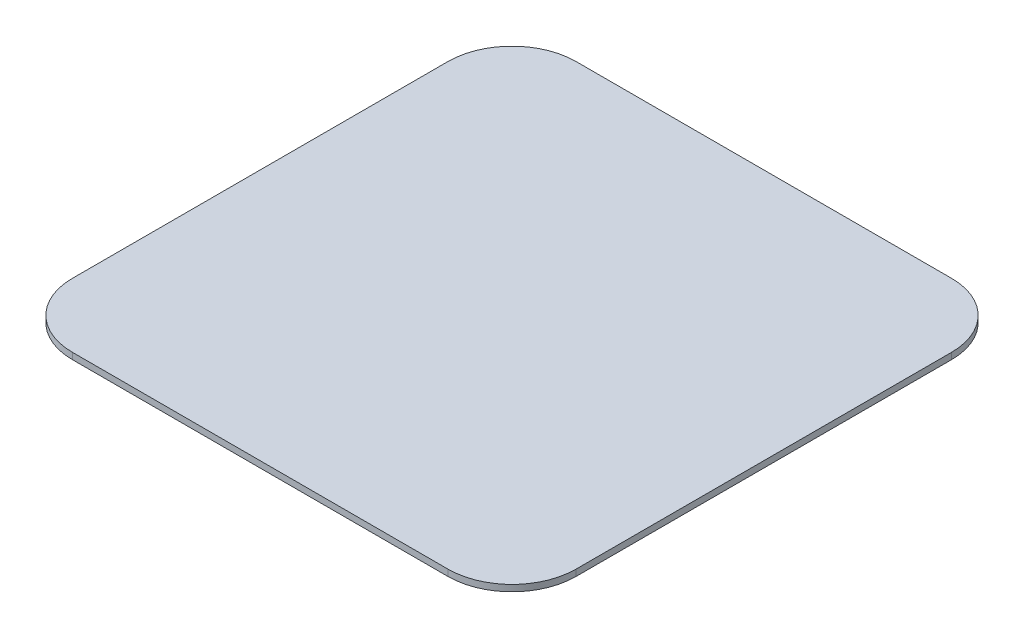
ISO-10303-21;
HEADER;
FILE_DESCRIPTION(('STEP AP214'),'2;1');
FILE_NAME('part.step','',(''),(''),'','','');
FILE_SCHEMA(('AUTOMOTIVE_DESIGN { 1 0 10303 214 1 1 1 1 }'));
ENDSEC;
DATA;
#1=APPLICATION_CONTEXT('core data for automotive mechanical design processes');
#2=APPLICATION_PROTOCOL_DEFINITION('international standard','automotive_design',2000,#1);
#3=PRODUCT_CONTEXT('',#1,'mechanical');
#4=PRODUCT('Part','Part','',(#3));
#5=PRODUCT_RELATED_PRODUCT_CATEGORY('part','',(#4));
#6=PRODUCT_DEFINITION_FORMATION('','',#4);
#7=PRODUCT_DEFINITION_CONTEXT('part definition',#1,'design');
#8=PRODUCT_DEFINITION('design','',#6,#7);
#9=PRODUCT_DEFINITION_SHAPE('','',#8);
#10=(LENGTH_UNIT() NAMED_UNIT(*) SI_UNIT(.MILLI.,.METRE.));
#11=(NAMED_UNIT(*) PLANE_ANGLE_UNIT() SI_UNIT($,.RADIAN.));
#12=(NAMED_UNIT(*) SI_UNIT($,.STERADIAN.) SOLID_ANGLE_UNIT());
#13=UNCERTAINTY_MEASURE_WITH_UNIT(LENGTH_MEASURE(1.E-05),#10,'distance_accuracy_value','');
#14=(GEOMETRIC_REPRESENTATION_CONTEXT(3) GLOBAL_UNCERTAINTY_ASSIGNED_CONTEXT((#13)) GLOBAL_UNIT_ASSIGNED_CONTEXT((#10,
#11,#12)) REPRESENTATION_CONTEXT('',''));
#15=CARTESIAN_POINT('',(0.,0.,0.));
#16=DIRECTION('',(0.,0.,1.));
#17=DIRECTION('',(1.,0.,0.));
#18=AXIS2_PLACEMENT_3D('',#15,#16,#17);
#19=CARTESIAN_POINT('',(0.,25.4,0.));
#20=DIRECTION('',(1.,0.,0.));
#21=DIRECTION('',(0.,0.,-1.));
#22=AXIS2_PLACEMENT_3D('',#19,#20,#21);
#23=PLANE('',#22);
#24=DIRECTION('',(0.,0.,1.));
#25=VECTOR('',#24,1.);
#26=CARTESIAN_POINT('',(0.,25.4,0.));
#27=LINE('',#26,#25);
#28=CARTESIAN_POINT('',(0.,25.4,-1746.));
#29=VERTEX_POINT('',#28);
#30=CARTESIAN_POINT('',(0.,25.4,-254.));
#31=VERTEX_POINT('',#30);
#32=EDGE_CURVE('E119',#29,#31,#27,.T.);
#33=ORIENTED_EDGE('',*,*,#32,.F.);
#34=DIRECTION('',(0.,-1.,0.));
#35=VECTOR('',#34,1.);
#36=CARTESIAN_POINT('',(0.,25.4,-1746.));
#37=LINE('',#36,#35);
#38=CARTESIAN_POINT('',(0.,0.,-1746.));
#39=VERTEX_POINT('',#38);
#40=EDGE_CURVE('E104',#29,#39,#37,.T.);
#41=ORIENTED_EDGE('',*,*,#40,.T.);
#42=DIRECTION('',(0.,0.,1.));
#43=VECTOR('',#42,1.);
#44=CARTESIAN_POINT('',(0.,0.,0.));
#45=LINE('',#44,#43);
#46=CARTESIAN_POINT('',(0.,0.,-254.));
#47=VERTEX_POINT('',#46);
#48=EDGE_CURVE('E116',#39,#47,#45,.T.);
#49=ORIENTED_EDGE('',*,*,#48,.T.);
#50=DIRECTION('',(0.,-1.,0.));
#51=VECTOR('',#50,1.);
#52=CARTESIAN_POINT('',(0.,25.4,-254.));
#53=LINE('',#52,#51);
#54=EDGE_CURVE('E121',#47,#31,#53,.F.);
#55=ORIENTED_EDGE('',*,*,#54,.T.);
#56=EDGE_LOOP('',(#33,#41,#49,#55));
#57=FACE_BOUND('',#56,.T.);
#58=ADVANCED_FACE('F34',(#57),#23,.F.);
#59=CARTESIAN_POINT('',(0.,25.4,0.));
#60=DIRECTION('',(0.,0.,-1.));
#61=DIRECTION('',(-1.,0.,0.));
#62=AXIS2_PLACEMENT_3D('',#59,#60,#61);
#63=PLANE('',#62);
#64=DIRECTION('',(1.,0.,0.));
#65=VECTOR('',#64,1.);
#66=CARTESIAN_POINT('',(0.,0.,0.));
#67=LINE('',#66,#65);
#68=CARTESIAN_POINT('',(254.,0.,0.));
#69=VERTEX_POINT('',#68);
#70=CARTESIAN_POINT('',(1746.,0.,0.));
#71=VERTEX_POINT('',#70);
#72=EDGE_CURVE('E125',#69,#71,#67,.T.);
#73=ORIENTED_EDGE('',*,*,#72,.T.);
#74=DIRECTION('',(0.,-1.,0.));
#75=VECTOR('',#74,1.);
#76=CARTESIAN_POINT('',(1746.,25.4,0.));
#77=LINE('',#76,#75);
#78=CARTESIAN_POINT('',(1746.,25.4,0.));
#79=VERTEX_POINT('',#78);
#80=EDGE_CURVE('E11',#71,#79,#77,.F.);
#81=ORIENTED_EDGE('',*,*,#80,.T.);
#82=DIRECTION('',(1.,0.,0.));
#83=VECTOR('',#82,1.);
#84=CARTESIAN_POINT('',(0.,25.4,0.));
#85=LINE('',#84,#83);
#86=CARTESIAN_POINT('',(254.,25.4,0.));
#87=VERTEX_POINT('',#86);
#88=EDGE_CURVE('E161',#87,#79,#85,.T.);
#89=ORIENTED_EDGE('',*,*,#88,.F.);
#90=DIRECTION('',(0.,-1.,0.));
#91=VECTOR('',#90,1.);
#92=CARTESIAN_POINT('',(254.,25.4,0.));
#93=LINE('',#92,#91);
#94=EDGE_CURVE('E42',#87,#69,#93,.T.);
#95=ORIENTED_EDGE('',*,*,#94,.T.);
#96=EDGE_LOOP('',(#73,#81,#89,#95));
#97=FACE_BOUND('',#96,.T.);
#98=ADVANCED_FACE('F159',(#97),#63,.F.);
#99=CARTESIAN_POINT('',(2000.,25.4,0.));
#100=DIRECTION('',(-1.,0.,0.));
#101=DIRECTION('',(0.,0.,1.));
#102=AXIS2_PLACEMENT_3D('',#99,#100,#101);
#103=PLANE('',#102);
#104=DIRECTION('',(0.,0.,-1.));
#105=VECTOR('',#104,1.);
#106=CARTESIAN_POINT('',(2000.,0.,0.));
#107=LINE('',#106,#105);
#108=CARTESIAN_POINT('',(2000.,0.,-254.));
#109=VERTEX_POINT('',#108);
#110=CARTESIAN_POINT('',(2000.,0.,-1746.));
#111=VERTEX_POINT('',#110);
#112=EDGE_CURVE('E128',#109,#111,#107,.T.);
#113=ORIENTED_EDGE('',*,*,#112,.T.);
#114=DIRECTION('',(0.,-1.,0.));
#115=VECTOR('',#114,1.);
#116=CARTESIAN_POINT('',(2000.,25.4,-1746.));
#117=LINE('',#116,#115);
#118=CARTESIAN_POINT('',(2000.,25.4,-1746.));
#119=VERTEX_POINT('',#118);
#120=EDGE_CURVE('E49',#111,#119,#117,.F.);
#121=ORIENTED_EDGE('',*,*,#120,.T.);
#122=DIRECTION('',(0.,0.,-1.));
#123=VECTOR('',#122,1.);
#124=CARTESIAN_POINT('',(2000.,25.4,0.));
#125=LINE('',#124,#123);
#126=CARTESIAN_POINT('',(2000.,25.4,-254.));
#127=VERTEX_POINT('',#126);
#128=EDGE_CURVE('E169',#127,#119,#125,.T.);
#129=ORIENTED_EDGE('',*,*,#128,.F.);
#130=DIRECTION('',(0.,-1.,0.));
#131=VECTOR('',#130,1.);
#132=CARTESIAN_POINT('',(2000.,25.4,-254.));
#133=LINE('',#132,#131);
#134=EDGE_CURVE('E152',#127,#109,#133,.T.);
#135=ORIENTED_EDGE('',*,*,#134,.T.);
#136=EDGE_LOOP('',(#113,#121,#129,#135));
#137=FACE_BOUND('',#136,.T.);
#138=ADVANCED_FACE('F168',(#137),#103,.F.);
#139=CARTESIAN_POINT('',(0.,25.4,-2000.));
#140=DIRECTION('',(0.,0.,1.));
#141=DIRECTION('',(1.,0.,0.));
#142=AXIS2_PLACEMENT_3D('',#139,#140,#141);
#143=PLANE('',#142);
#144=DIRECTION('',(-1.,0.,0.));
#145=VECTOR('',#144,1.);
#146=CARTESIAN_POINT('',(0.,0.,-2000.));
#147=LINE('',#146,#145);
#148=CARTESIAN_POINT('',(1746.,0.,-2000.));
#149=VERTEX_POINT('',#148);
#150=CARTESIAN_POINT('',(254.,0.,-2000.));
#151=VERTEX_POINT('',#150);
#152=EDGE_CURVE('E135',#149,#151,#147,.T.);
#153=ORIENTED_EDGE('',*,*,#152,.T.);
#154=DIRECTION('',(0.,-1.,0.));
#155=VECTOR('',#154,1.);
#156=CARTESIAN_POINT('',(254.,25.4,-2000.));
#157=LINE('',#156,#155);
#158=CARTESIAN_POINT('',(254.,25.4,-2000.));
#159=VERTEX_POINT('',#158);
#160=EDGE_CURVE('E105',#151,#159,#157,.F.);
#161=ORIENTED_EDGE('',*,*,#160,.T.);
#162=DIRECTION('',(-1.,0.,0.));
#163=VECTOR('',#162,1.);
#164=CARTESIAN_POINT('',(0.,25.4,-2000.));
#165=LINE('',#164,#163);
#166=CARTESIAN_POINT('',(1746.,25.4,-2000.));
#167=VERTEX_POINT('',#166);
#168=EDGE_CURVE('E131',#167,#159,#165,.T.);
#169=ORIENTED_EDGE('',*,*,#168,.F.);
#170=DIRECTION('',(0.,-1.,0.));
#171=VECTOR('',#170,1.);
#172=CARTESIAN_POINT('',(1746.,25.4,-2000.));
#173=LINE('',#172,#171);
#174=EDGE_CURVE('E110',#167,#149,#173,.T.);
#175=ORIENTED_EDGE('',*,*,#174,.T.);
#176=EDGE_LOOP('',(#153,#161,#169,#175));
#177=FACE_BOUND('',#176,.T.);
#178=ADVANCED_FACE('F197',(#177),#143,.F.);
#179=CARTESIAN_POINT('',(0.,25.4,-2000.));
#180=DIRECTION('',(0.,-1.,0.));
#181=DIRECTION('',(0.,0.,-1.));
#182=AXIS2_PLACEMENT_3D('',#179,#180,#181);
#183=PLANE('',#182);
#184=ORIENTED_EDGE('',*,*,#168,.T.);
#185=CARTESIAN_POINT('',(254.,25.4,-1746.));
#186=DIRECTION('',(0.,-1.,0.));
#187=DIRECTION('',(0.,0.,-1.));
#188=AXIS2_PLACEMENT_3D('',#185,#186,#187);
#189=CIRCLE('',#188,254.);
#190=EDGE_CURVE('E150',#159,#29,#189,.F.);
#191=ORIENTED_EDGE('',*,*,#190,.T.);
#192=ORIENTED_EDGE('',*,*,#32,.T.);
#193=CARTESIAN_POINT('',(254.,25.4,-254.));
#194=DIRECTION('',(0.,-1.,0.));
#195=DIRECTION('',(0.,0.,-1.));
#196=AXIS2_PLACEMENT_3D('',#193,#194,#195);
#197=CIRCLE('',#196,254.);
#198=EDGE_CURVE('E145',#31,#87,#197,.F.);
#199=ORIENTED_EDGE('',*,*,#198,.T.);
#200=ORIENTED_EDGE('',*,*,#88,.T.);
#201=CARTESIAN_POINT('',(1746.,25.4,-254.));
#202=DIRECTION('',(0.,-1.,0.));
#203=DIRECTION('',(0.,0.,-1.));
#204=AXIS2_PLACEMENT_3D('',#201,#202,#203);
#205=CIRCLE('',#204,254.);
#206=EDGE_CURVE('E56',#79,#127,#205,.F.);
#207=ORIENTED_EDGE('',*,*,#206,.T.);
#208=ORIENTED_EDGE('',*,*,#128,.T.);
#209=CARTESIAN_POINT('',(1746.,25.4,-1746.));
#210=DIRECTION('',(0.,-1.,0.));
#211=DIRECTION('',(0.,0.,-1.));
#212=AXIS2_PLACEMENT_3D('',#209,#210,#211);
#213=CIRCLE('',#212,254.);
#214=EDGE_CURVE('E148',#119,#167,#213,.F.);
#215=ORIENTED_EDGE('',*,*,#214,.T.);
#216=EDGE_LOOP('',(#184,#191,#192,#199,#200,#207,#208,#215));
#217=FACE_BOUND('',#216,.T.);
#218=ADVANCED_FACE('F174',(#217),#183,.F.);
#219=CARTESIAN_POINT('',(0.,0.,-2000.));
#220=DIRECTION('',(0.,-1.,0.));
#221=DIRECTION('',(0.,0.,-1.));
#222=AXIS2_PLACEMENT_3D('',#219,#220,#221);
#223=PLANE('',#222);
#224=ORIENTED_EDGE('',*,*,#48,.F.);
#225=CARTESIAN_POINT('',(254.,0.,-1746.));
#226=DIRECTION('',(0.,-1.,0.));
#227=DIRECTION('',(0.,0.,-1.));
#228=AXIS2_PLACEMENT_3D('',#225,#226,#227);
#229=CIRCLE('',#228,254.);
#230=EDGE_CURVE('E100',#39,#151,#229,.T.);
#231=ORIENTED_EDGE('',*,*,#230,.T.);
#232=ORIENTED_EDGE('',*,*,#152,.F.);
#233=CARTESIAN_POINT('',(1746.,0.,-1746.));
#234=DIRECTION('',(0.,-1.,0.));
#235=DIRECTION('',(0.,0.,-1.));
#236=AXIS2_PLACEMENT_3D('',#233,#234,#235);
#237=CIRCLE('',#236,254.);
#238=EDGE_CURVE('E111',#149,#111,#237,.T.);
#239=ORIENTED_EDGE('',*,*,#238,.T.);
#240=ORIENTED_EDGE('',*,*,#112,.F.);
#241=CARTESIAN_POINT('',(1746.,0.,-254.));
#242=DIRECTION('',(0.,-1.,0.));
#243=DIRECTION('',(0.,0.,-1.));
#244=AXIS2_PLACEMENT_3D('',#241,#242,#243);
#245=CIRCLE('',#244,254.);
#246=EDGE_CURVE('E139',#109,#71,#245,.T.);
#247=ORIENTED_EDGE('',*,*,#246,.T.);
#248=ORIENTED_EDGE('',*,*,#72,.F.);
#249=CARTESIAN_POINT('',(254.,0.,-254.));
#250=DIRECTION('',(0.,-1.,0.));
#251=DIRECTION('',(0.,0.,-1.));
#252=AXIS2_PLACEMENT_3D('',#249,#250,#251);
#253=CIRCLE('',#252,254.);
#254=EDGE_CURVE('E120',#69,#47,#253,.T.);
#255=ORIENTED_EDGE('',*,*,#254,.T.);
#256=EDGE_LOOP('',(#224,#231,#232,#239,#240,#247,#248,#255));
#257=FACE_BOUND('',#256,.T.);
#258=ADVANCED_FACE('F123',(#257),#223,.T.);
#259=CARTESIAN_POINT('',(254.,25.4,-1746.));
#260=DIRECTION('',(0.,-1.,0.));
#261=DIRECTION('',(0.,0.,-1.));
#262=AXIS2_PLACEMENT_3D('',#259,#260,#261);
#263=CYLINDRICAL_SURFACE('',#262,254.);
#264=ORIENTED_EDGE('',*,*,#190,.F.);
#265=ORIENTED_EDGE('',*,*,#160,.F.);
#266=ORIENTED_EDGE('',*,*,#230,.F.);
#267=ORIENTED_EDGE('',*,*,#40,.F.);
#268=EDGE_LOOP('',(#264,#265,#266,#267));
#269=FACE_BOUND('',#268,.T.);
#270=ADVANCED_FACE('F103',(#269),#263,.T.);
#271=CARTESIAN_POINT('',(1746.,25.4,-1746.));
#272=DIRECTION('',(0.,-1.,0.));
#273=DIRECTION('',(0.,0.,-1.));
#274=AXIS2_PLACEMENT_3D('',#271,#272,#273);
#275=CYLINDRICAL_SURFACE('',#274,254.);
#276=ORIENTED_EDGE('',*,*,#214,.F.);
#277=ORIENTED_EDGE('',*,*,#120,.F.);
#278=ORIENTED_EDGE('',*,*,#238,.F.);
#279=ORIENTED_EDGE('',*,*,#174,.F.);
#280=EDGE_LOOP('',(#276,#277,#278,#279));
#281=FACE_BOUND('',#280,.T.);
#282=ADVANCED_FACE('F179',(#281),#275,.T.);
#283=CARTESIAN_POINT('',(1746.,25.4,-254.));
#284=DIRECTION('',(0.,-1.,0.));
#285=DIRECTION('',(0.,0.,-1.));
#286=AXIS2_PLACEMENT_3D('',#283,#284,#285);
#287=CYLINDRICAL_SURFACE('',#286,254.);
#288=ORIENTED_EDGE('',*,*,#206,.F.);
#289=ORIENTED_EDGE('',*,*,#80,.F.);
#290=ORIENTED_EDGE('',*,*,#246,.F.);
#291=ORIENTED_EDGE('',*,*,#134,.F.);
#292=EDGE_LOOP('',(#288,#289,#290,#291));
#293=FACE_BOUND('',#292,.T.);
#294=ADVANCED_FACE('F167',(#293),#287,.T.);
#295=CARTESIAN_POINT('',(254.,25.4,-254.));
#296=DIRECTION('',(0.,-1.,0.));
#297=DIRECTION('',(0.,0.,-1.));
#298=AXIS2_PLACEMENT_3D('',#295,#296,#297);
#299=CYLINDRICAL_SURFACE('',#298,254.);
#300=ORIENTED_EDGE('',*,*,#198,.F.);
#301=ORIENTED_EDGE('',*,*,#54,.F.);
#302=ORIENTED_EDGE('',*,*,#254,.F.);
#303=ORIENTED_EDGE('',*,*,#94,.F.);
#304=EDGE_LOOP('',(#300,#301,#302,#303));
#305=FACE_BOUND('',#304,.T.);
#306=ADVANCED_FACE('F36',(#305),#299,.T.);
#307=CLOSED_SHELL('',(#58,#98,#138,#178,#218,#258,#270,#282,#294,#306));
#308=MANIFOLD_SOLID_BREP('B2',#307);
#309=ADVANCED_BREP_SHAPE_REPRESENTATION('',(#18,#308),#14);
#310=SHAPE_DEFINITION_REPRESENTATION(#9,#309);
ENDSEC;
END-ISO-10303-21;
